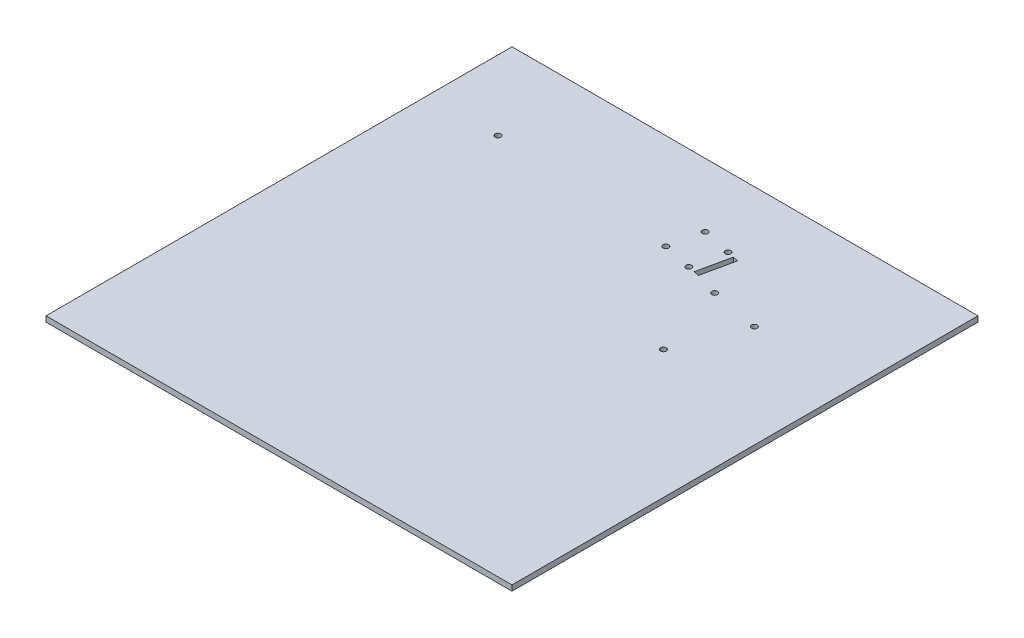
from build123d import *

# Parameters (mm, degrees)
SKETCH2_W           = 254
SKETCH2_H           = 254
SKETCH2_R           = 1.5499842
BOSS_EXTRUDE1_DEPTH = 2.999994


with BuildPart() as part:
    # Sketch2 → Boss-Extrude1 (new body)
    with BuildSketch(Plane(origin=(0, 0, 0), x_dir=(1, 0, 0), z_dir=(0, 1, 0))):
        Rectangle(SKETCH2_W, SKETCH2_H)
        with Locations(Location((57.15, 25.4, 0), (0, 0, 270))):
            Circle(SKETCH2_R, mode=Mode.SUBTRACT)
        with Locations(Location((71.12, 60.96, 0), (0, 0, 270))):
            Circle(SKETCH2_R, mode=Mode.SUBTRACT)
        with Locations(Location((44.45, 66.04, 0), (0, 0, 270))):
            Circle(SKETCH2_R, mode=Mode.SUBTRACT)
        with Locations(Location((9.188581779, 74.698996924, 0), (0, 0, 270))):
            Circle(SKETCH2_R, mode=Mode.SUBTRACT)
        with Locations(Location((12.966758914, 92.278103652, 0), (0, 0, 270))):
            Circle(SKETCH2_R, mode=Mode.SUBTRACT)
        with Locations(Location((28.846200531, 88.865225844, 0), (0, 0, 270))):
            Circle(SKETCH2_R, mode=Mode.SUBTRACT)
        with Locations(Location((25.068023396, 71.286119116, 0), (0, 0, 270))):
            Circle(SKETCH2_R, mode=Mode.SUBTRACT)
        with Locations(Location((-88.9, 81.28, 0), (0, 0, 270))):
            Circle(SKETCH2_R, mode=Mode.SUBTRACT)
        Polygon((31.75, 69.85), (28.846200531, 70.474097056), (32.624377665, 88.053203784), (35.528177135, 87.429106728), align=None, mode=Mode.SUBTRACT)
    extrude(amount=BOSS_EXTRUDE1_DEPTH)


solid = part.part
